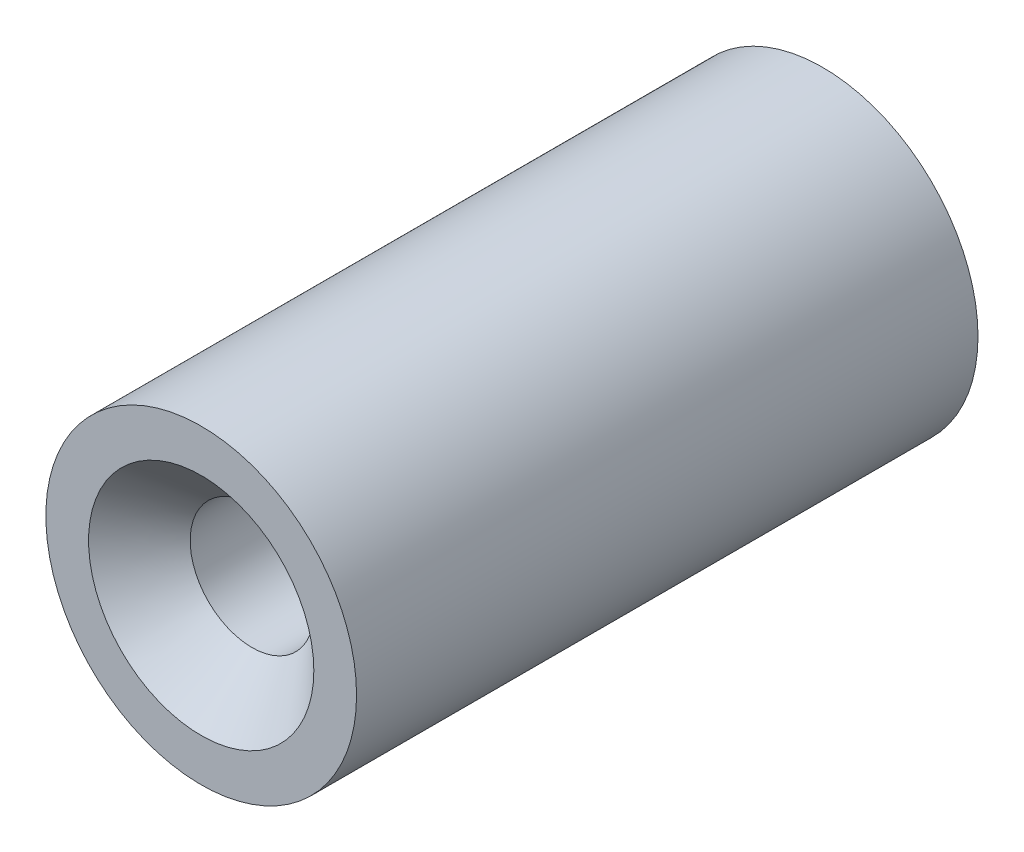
from build123d import *

# Parameters (mm, degrees)
SKETCH1_R                            = 6.35
BOSS_EXTRUDE1_DEPTH                  = 25.4
F_8_0_199_DIAMETER_HOLE1_D           = 5.0546
F_8_0_199_DIAMETER_HOLE1_CSINK_D     = 9.2075
F_8_0_199_DIAMETER_HOLE1_CSINK_ANGLE = 90


with BuildPart() as part:
    # Sketch1 → Boss-Extrude1 (new body)
    with BuildSketch(Plane.XY):
        with Locations((-32.031602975, 23.011209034)):
            Circle(SKETCH1_R)
    extrude(amount=BOSS_EXTRUDE1_DEPTH)

    # 8 _0.199_ Diameter Hole1 (through all)
    with Locations(Plane.XY.offset(25.4)):
        with Locations((-32.031602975, 23.011209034)):
            CounterSinkHole(F_8_0_199_DIAMETER_HOLE1_D / 2, F_8_0_199_DIAMETER_HOLE1_CSINK_D / 2, counter_sink_angle=F_8_0_199_DIAMETER_HOLE1_CSINK_ANGLE)


solid = part.part
